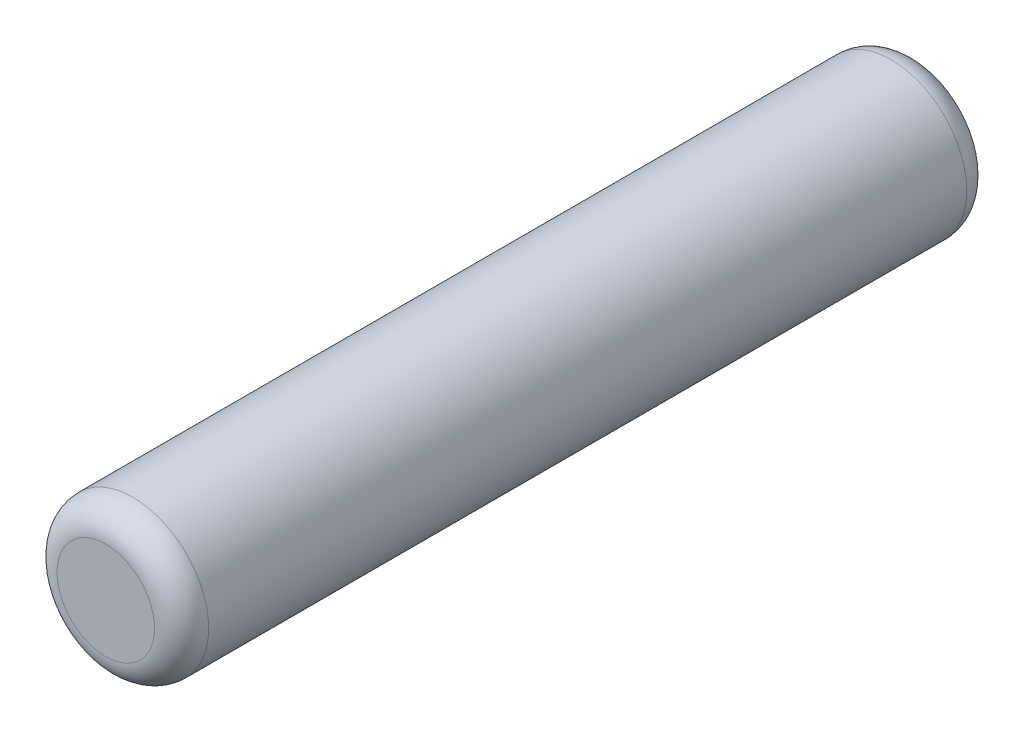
from build123d import *

# Parameters (mm, degrees)
SKETCH_1_R      = 1.4
EXTRUDE_1_DEPTH = 15
FILLET_1_R      = 0.5


with BuildPart() as part:
    # Sketch 1 → Extrude 1 (new body)
    with BuildSketch(Plane.XY):
        Circle(SKETCH_1_R)
    extrude(amount=EXTRUDE_1_DEPTH)

    # Fillet 1
    fillet_1_edges = [part.edges().sort_by_distance(p)[0] for p in [
        (-1.4, 0, 0),
        (-1.4, 0, 15),
    ]]
    fillet(fillet_1_edges, radius=FILLET_1_R)


solid = part.part
